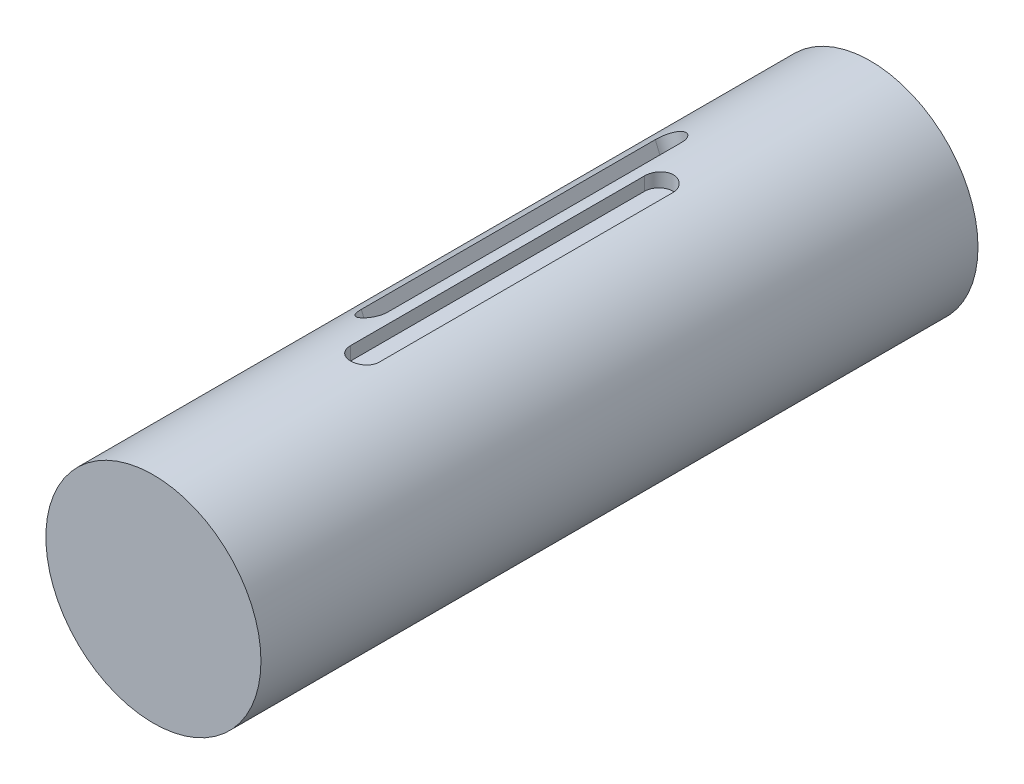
ISO-10303-21;
HEADER;
FILE_DESCRIPTION(('STEP AP214'),'2;1');
FILE_NAME('part.step','',(''),(''),'','','');
FILE_SCHEMA(('AUTOMOTIVE_DESIGN { 1 0 10303 214 1 1 1 1 }'));
ENDSEC;
DATA;
#1=APPLICATION_CONTEXT('core data for automotive mechanical design processes');
#2=APPLICATION_PROTOCOL_DEFINITION('international standard','automotive_design',2000,#1);
#3=PRODUCT_CONTEXT('',#1,'mechanical');
#4=PRODUCT('Part','Part','',(#3));
#5=PRODUCT_RELATED_PRODUCT_CATEGORY('part','',(#4));
#6=PRODUCT_DEFINITION_FORMATION('','',#4);
#7=PRODUCT_DEFINITION_CONTEXT('part definition',#1,'design');
#8=PRODUCT_DEFINITION('design','',#6,#7);
#9=PRODUCT_DEFINITION_SHAPE('','',#8);
#10=(LENGTH_UNIT() NAMED_UNIT(*) SI_UNIT(.MILLI.,.METRE.));
#11=(NAMED_UNIT(*) PLANE_ANGLE_UNIT() SI_UNIT($,.RADIAN.));
#12=(NAMED_UNIT(*) SI_UNIT($,.STERADIAN.) SOLID_ANGLE_UNIT());
#13=UNCERTAINTY_MEASURE_WITH_UNIT(LENGTH_MEASURE(1.E-05),#10,'distance_accuracy_value','');
#14=(GEOMETRIC_REPRESENTATION_CONTEXT(3) GLOBAL_UNCERTAINTY_ASSIGNED_CONTEXT((#13)) GLOBAL_UNIT_ASSIGNED_CONTEXT((#10,
#11,#12)) REPRESENTATION_CONTEXT('',''));
#15=CARTESIAN_POINT('',(0.,0.,0.));
#16=DIRECTION('',(0.,0.,1.));
#17=DIRECTION('',(1.,0.,0.));
#18=AXIS2_PLACEMENT_3D('',#15,#16,#17);
#19=CARTESIAN_POINT('',(0.,0.,-50.));
#20=DIRECTION('',(0.,0.,1.));
#21=DIRECTION('',(1.,0.,0.));
#22=AXIS2_PLACEMENT_3D('',#19,#20,#21);
#23=CYLINDRICAL_SURFACE('',#22,15.);
#24=CARTESIAN_POINT('',(-3.80554326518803,14.5092329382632,-27.5));
#25=CARTESIAN_POINT('',(-3.80554262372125,14.509231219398,-27.5559903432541));
#26=CARTESIAN_POINT('',(-3.80784030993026,14.5086306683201,-27.6119536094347));
#27=CARTESIAN_POINT('',(-3.81700015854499,14.5062242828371,-27.7234746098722));
#28=CARTESIAN_POINT('',(-3.82386194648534,14.5044185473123,-27.7790323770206));
#29=CARTESIAN_POINT('',(-3.85120980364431,14.4971914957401,-27.9443668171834));
#30=CARTESIAN_POINT('',(-3.87845865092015,14.4899603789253,-28.0530279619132));
#31=CARTESIAN_POINT('',(-3.95007976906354,14.4705987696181,-28.2640593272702));
#32=CARTESIAN_POINT('',(-3.99445723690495,14.458466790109,-28.3664276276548));
#33=CARTESIAN_POINT('',(-4.09887286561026,14.4292123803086,-28.5620626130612));
#34=CARTESIAN_POINT('',(-4.15891011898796,14.4120902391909,-28.6553298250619));
#35=CARTESIAN_POINT('',(-4.29312661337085,14.3726813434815,-28.8307008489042));
#36=CARTESIAN_POINT('',(-4.3673853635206,14.3503653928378,-28.9127372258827));
#37=CARTESIAN_POINT('',(-4.52752033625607,14.3006494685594,-29.0627508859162));
#38=CARTESIAN_POINT('',(-4.61339834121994,14.2732487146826,-29.1307260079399));
#39=CARTESIAN_POINT('',(-4.79451924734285,14.2134339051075,-29.2509340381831));
#40=CARTESIAN_POINT('',(-4.88979857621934,14.1810000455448,-29.3031022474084));
#41=CARTESIAN_POINT('',(-5.0865345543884,14.111627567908,-29.3898012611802));
#42=CARTESIAN_POINT('',(-5.18799058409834,14.0746894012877,-29.4243338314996));
#43=CARTESIAN_POINT('',(-5.39343195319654,13.9972449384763,-29.4745861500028));
#44=CARTESIAN_POINT('',(-5.497398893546,13.95676092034,-29.4904154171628));
#45=CARTESIAN_POINT('',(-5.70538260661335,13.8730376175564,-29.5031483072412));
#46=CARTESIAN_POINT('',(-5.80939937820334,13.8297983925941,-29.5000523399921));
#47=CARTESIAN_POINT('',(-6.01382113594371,13.7421340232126,-29.4751098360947));
#48=CARTESIAN_POINT('',(-6.11424539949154,13.6977185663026,-29.4533869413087));
#49=CARTESIAN_POINT('',(-6.30945608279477,13.6089041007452,-29.3919977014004));
#50=CARTESIAN_POINT('',(-6.40424242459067,13.5645050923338,-29.3523311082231));
#51=CARTESIAN_POINT('',(-6.58594887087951,13.4772206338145,-29.2560677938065));
#52=CARTESIAN_POINT('',(-6.67284644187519,13.4343397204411,-29.1994244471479));
#53=CARTESIAN_POINT('',(-6.83629304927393,13.3519095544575,-29.0708514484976));
#54=CARTESIAN_POINT('',(-6.9128419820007,13.3123603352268,-28.9989216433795));
#55=CARTESIAN_POINT('',(-7.05426616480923,13.2379671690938,-28.8411704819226));
#56=CARTESIAN_POINT('',(-7.11904874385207,13.203161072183,-28.7552481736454));
#57=CARTESIAN_POINT('',(-7.23466425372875,13.1401667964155,-28.572262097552));
#58=CARTESIAN_POINT('',(-7.28549306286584,13.1119805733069,-28.4751950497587));
#59=CARTESIAN_POINT('',(-7.37199375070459,13.0635438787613,-28.2725465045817));
#60=CARTESIAN_POINT('',(-7.40764574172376,13.0433038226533,-28.1669540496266));
#61=CARTESIAN_POINT('',(-7.46277304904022,13.0118424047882,-27.9504306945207));
#62=CARTESIAN_POINT('',(-7.48227262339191,13.0006075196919,-27.8395080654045));
#63=CARTESIAN_POINT('',(-7.49726210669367,12.9919617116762,-27.6898156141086));
#64=CARTESIAN_POINT('',(-7.500100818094,12.9903229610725,-27.6518928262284));
#65=CARTESIAN_POINT('',(-7.50388118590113,12.9881397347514,-27.5759854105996));
#66=CARTESIAN_POINT('',(-7.50482602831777,12.9875934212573,-27.5380009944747));
#67=CARTESIAN_POINT('',(-7.50482793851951,12.987592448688,-27.5));
#68=B_SPLINE_CURVE_WITH_KNOTS('',3,(#24,#25,#26,#27,#28,#29,#30,#31,#32,#33,#34,#35,#36,#37,#38,
#39,#40,#41,#42,#43,#44,#45,#46,#47,#48,#49,#50,#51,#52,#53,#54,#55,#56,#57,#58,#59,#60,#61,#62,
#63,#64,#65,#66,#67),.UNSPECIFIED.,.F.,.F.,(4,2,2,2,2,2,2,2,2,2,2,2,2,2,2,2,2,2,2,2,2,4),(0.,
0.167867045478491,0.335720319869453,0.670765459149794,1.00591233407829,1.34103979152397,
1.6780986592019,2.01520929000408,2.35368166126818,2.69212013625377,3.02856687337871,
3.36500632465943,3.69922969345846,4.03345768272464,4.36861215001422,4.70376997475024,
5.04146271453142,5.37925509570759,5.71748876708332,6.0552135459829,6.16935992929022,
6.28331412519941),.UNSPECIFIED.);
#69=CARTESIAN_POINT('',(-3.80554326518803,14.5092329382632,-27.5));
#70=VERTEX_POINT('',#69);
#71=CARTESIAN_POINT('',(-7.50482793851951,12.987592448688,-27.5));
#72=VERTEX_POINT('',#71);
#73=EDGE_CURVE('E11',#70,#72,#68,.T.);
#74=ORIENTED_EDGE('',*,*,#73,.F.);
#75=DIRECTION('',(0.,0.,1.));
#76=VECTOR('',#75,1.);
#77=CARTESIAN_POINT('',(-3.80554326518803,14.5092329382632,-50.));
#78=LINE('',#77,#76);
#79=CARTESIAN_POINT('',(-3.80554326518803,14.5092329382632,13.5));
#80=VERTEX_POINT('',#79);
#81=EDGE_CURVE('E104',#80,#70,#78,.F.);
#82=ORIENTED_EDGE('',*,*,#81,.F.);
#83=CARTESIAN_POINT('',(-7.50482793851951,12.987592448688,13.5));
#84=CARTESIAN_POINT('',(-7.50482715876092,12.9875907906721,13.5560131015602));
#85=CARTESIAN_POINT('',(-7.50277163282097,12.9887809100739,13.6119991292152));
#86=CARTESIAN_POINT('',(-7.49456837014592,12.9935167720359,13.7235657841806));
#87=CARTESIAN_POINT('',(-7.48842096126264,12.9970623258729,13.7791464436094));
#88=CARTESIAN_POINT('',(-7.4638981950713,13.0111722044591,13.9445521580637));
#89=CARTESIAN_POINT('',(-7.43944213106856,13.0252099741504,14.0532616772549));
#90=CARTESIAN_POINT('',(-7.37490663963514,13.0618571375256,14.2643887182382));
#91=CARTESIAN_POINT('',(-7.33482232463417,13.0844692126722,14.3668042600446));
#92=CARTESIAN_POINT('',(-7.24000186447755,13.1371726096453,14.5625256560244));
#93=CARTESIAN_POINT('',(-7.18526668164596,13.1672634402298,14.655832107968));
#94=CARTESIAN_POINT('',(-7.06212158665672,13.2337200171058,14.8312341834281));
#95=CARTESIAN_POINT('',(-6.99363958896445,13.2701186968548,14.9132666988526));
#96=CARTESIAN_POINT('',(-6.84483743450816,13.3474798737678,15.063261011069));
#97=CARTESIAN_POINT('',(-6.76451548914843,13.3884430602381,15.1312206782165));
#98=CARTESIAN_POINT('',(-6.59373460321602,13.4733728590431,15.2513480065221));
#99=CARTESIAN_POINT('',(-6.50324144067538,13.5173494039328,15.3034600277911));
#100=CARTESIAN_POINT('',(-6.31470434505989,13.6064457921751,15.3900512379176));
#101=CARTESIAN_POINT('',(-6.21666117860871,13.6515655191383,15.4245322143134));
#102=CARTESIAN_POINT('',(-6.01628444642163,13.7410437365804,15.4746891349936));
#103=CARTESIAN_POINT('',(-5.91398001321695,13.7854051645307,15.4904761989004));
#104=CARTESIAN_POINT('',(-5.70740378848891,13.8722056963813,15.5031450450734));
#105=CARTESIAN_POINT('',(-5.60313203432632,13.9146448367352,15.5000271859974));
#106=CARTESIAN_POINT('',(-5.39627285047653,13.996161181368,15.4750621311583));
#107=CARTESIAN_POINT('',(-5.29367901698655,14.0352573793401,15.4533297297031));
#108=CARTESIAN_POINT('',(-5.09250651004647,14.1094961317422,15.3919354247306));
#109=CARTESIAN_POINT('',(-4.99392790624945,14.1446386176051,15.3522732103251));
#110=CARTESIAN_POINT('',(-4.80336236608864,14.2104862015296,15.2560056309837));
#111=CARTESIAN_POINT('',(-4.7113986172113,14.241176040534,15.1993439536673));
#112=CARTESIAN_POINT('',(-4.53716925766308,14.2976394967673,15.0707294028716));
#113=CARTESIAN_POINT('',(-4.45490375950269,14.323413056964,14.9987763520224));
#114=CARTESIAN_POINT('',(-4.30196859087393,14.3700912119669,14.8409581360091));
#115=CARTESIAN_POINT('',(-4.23139348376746,14.3909566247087,14.7549897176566));
#116=CARTESIAN_POINT('',(-4.10482638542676,14.4275693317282,14.5718986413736));
#117=CARTESIAN_POINT('',(-4.04883868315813,14.4433151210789,14.4747727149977));
#118=CARTESIAN_POINT('',(-3.95325950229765,14.4697688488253,14.2720362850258));
#119=CARTESIAN_POINT('',(-3.91368284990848,14.4804722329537,14.1664182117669));
#120=CARTESIAN_POINT('',(-3.85238664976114,14.4969010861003,13.949841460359));
#121=CARTESIAN_POINT('',(-3.83064017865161,14.5026340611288,13.8388911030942));
#122=CARTESIAN_POINT('',(-3.81395139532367,14.5070252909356,13.6892787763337));
#123=CARTESIAN_POINT('',(-3.8107970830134,14.5078540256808,13.6514629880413));
#124=CARTESIAN_POINT('',(-3.80659580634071,14.5089570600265,13.5757701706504));
#125=CARTESIAN_POINT('',(-3.80554530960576,14.5092322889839,13.5378933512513));
#126=CARTESIAN_POINT('',(-3.80554326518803,14.5092329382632,13.5));
#127=B_SPLINE_CURVE_WITH_KNOTS('',3,(#83,#84,#85,#86,#87,#88,#89,#90,#91,#92,#93,#94,#95,#96,
#97,#98,#99,#100,#101,#102,#103,#104,#105,#106,#107,#108,#109,#110,#111,#112,#113,#114,#115,
#116,#117,#118,#119,#120,#121,#122,#123,#124,#125,#126),.UNSPECIFIED.,.F.,.F.,(4,2,2,2,2,2,2,2,
2,2,2,2,2,2,2,2,2,2,2,2,2,4),(0.,0.167935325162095,0.335857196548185,0.671047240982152,
1.00634219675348,1.34161513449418,1.67869439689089,2.01582463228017,2.35412519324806,
2.69239144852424,3.02863673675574,3.36487564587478,3.69905580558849,4.0332417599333,
4.36854719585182,4.70385652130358,5.04175810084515,5.37975891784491,5.71806443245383,
6.05585816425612,6.16968090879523,6.28331238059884),.UNSPECIFIED.);
#128=CARTESIAN_POINT('',(-7.50482793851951,12.987592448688,13.5));
#129=VERTEX_POINT('',#128);
#130=EDGE_CURVE('E190',#129,#80,#127,.T.);
#131=ORIENTED_EDGE('',*,*,#130,.F.);
#132=DIRECTION('',(0.,0.,1.));
#133=VECTOR('',#132,1.);
#134=CARTESIAN_POINT('',(-7.50482793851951,12.987592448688,-50.));
#135=LINE('',#134,#133);
#136=EDGE_CURVE('E45',#72,#129,#135,.T.);
#137=ORIENTED_EDGE('',*,*,#136,.F.);
#138=EDGE_LOOP('',(#74,#82,#131,#137));
#139=FACE_BOUND('',#138,.T.);
#140=CARTESIAN_POINT('',(2.,14.8660687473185,-20.5));
#141=CARTESIAN_POINT('',(1.99999992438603,14.8660669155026,-20.5560018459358));
#142=CARTESIAN_POINT('',(1.9976463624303,14.8663855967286,-20.6119766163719));
#143=CARTESIAN_POINT('',(1.98825899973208,14.8676447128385,-20.7235206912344));
#144=CARTESIAN_POINT('',(1.98122557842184,14.8685850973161,-20.7790900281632));
#145=CARTESIAN_POINT('',(1.95318170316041,14.8723051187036,-20.9444604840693));
#146=CARTESIAN_POINT('',(1.92522739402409,14.8759837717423,-21.0531460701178));
#147=CARTESIAN_POINT('',(1.85161406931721,14.8853244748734,-21.2642257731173));
#148=CARTESIAN_POINT('',(1.80594959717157,14.8909871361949,-21.3666179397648));
#149=CARTESIAN_POINT('',(1.69823201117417,14.9036551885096,-21.5622965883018));
#150=CARTESIAN_POINT('',(1.63617991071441,14.9106604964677,-21.6555836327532));
#151=CARTESIAN_POINT('',(1.49703717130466,14.9252733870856,-21.8309704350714));
#152=CARTESIAN_POINT('',(1.41986463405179,14.9328841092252,-21.9130049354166));
#153=CARTESIAN_POINT('',(1.25283835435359,14.9478230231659,-22.0630089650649));
#154=CARTESIAN_POINT('',(1.16298268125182,14.9551511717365,-22.1309763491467));
#155=CARTESIAN_POINT('',(0.972728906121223,14.9687311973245,-22.2511437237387));
#156=CARTESIAN_POINT('',(0.872292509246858,14.974978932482,-22.3032835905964));
#157=CARTESIAN_POINT('',(0.663997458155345,14.9856587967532,-22.3899281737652));
#158=CARTESIAN_POINT('',(0.556139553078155,14.9900911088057,-22.4244346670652));
#159=CARTESIAN_POINT('',(0.336736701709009,14.9966188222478,-22.474638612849));
#160=CARTESIAN_POINT('',(0.225217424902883,14.998727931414,-22.4904464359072));
#161=CARTESIAN_POINT('',(0.0010877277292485,15.000418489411,-22.5031466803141));
#162=CARTESIAN_POINT('',(-0.111522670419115,14.9999999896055,-22.5000394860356));
#163=CARTESIAN_POINT('',(-0.333880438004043,14.9966934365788,-22.4750852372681));
#164=CARTESIAN_POINT('',(-0.443641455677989,14.9938210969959,-22.4533574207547));
#165=CARTESIAN_POINT('',(-0.657944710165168,14.985947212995,-22.3919654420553));
#166=CARTESIAN_POINT('',(-0.762486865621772,14.980945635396,-22.3523010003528));
#167=CARTESIAN_POINT('',(-0.96375389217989,14.9693480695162,-22.2560355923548));
#168=CARTESIAN_POINT('',(-1.06045385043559,14.9627472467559,-22.1993831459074));
#169=CARTESIAN_POINT('',(-1.2430152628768,14.9486891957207,-22.0707896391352));
#170=CARTESIAN_POINT('',(-1.32887659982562,14.9412319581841,-21.9988484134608));
#171=CARTESIAN_POINT('',(-1.48801842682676,14.9262269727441,-21.8410641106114));
#172=CARTESIAN_POINT('',(-1.56119765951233,14.9186789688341,-21.7551189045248));
#173=CARTESIAN_POINT('',(-1.69213014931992,14.904396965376,-21.5720807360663));
#174=CARTESIAN_POINT('',(-1.74987885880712,14.897663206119,-21.4749844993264));
#175=CARTESIAN_POINT('',(-1.84831844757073,14.8857713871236,-21.2722922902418));
#176=CARTESIAN_POINT('',(-1.88899037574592,14.880615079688,-21.1666870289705));
#177=CARTESIAN_POINT('',(-1.9519345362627,14.8724905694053,-20.9501370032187));
#178=CARTESIAN_POINT('',(-1.97423443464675,14.8695190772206,-20.8392005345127));
#179=CARTESIAN_POINT('',(-1.99136249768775,14.8672285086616,-20.6895480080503));
#180=CARTESIAN_POINT('',(-1.99460306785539,14.8667939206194,-20.6516785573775));
#181=CARTESIAN_POINT('',(-1.99891893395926,14.8662143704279,-20.57587811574));
#182=CARTESIAN_POINT('',(-1.99999786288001,14.8660689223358,-20.5379473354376));
#183=CARTESIAN_POINT('',(-2.,14.8660687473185,-20.5));
#184=B_SPLINE_CURVE_WITH_KNOTS('',3,(#140,#141,#142,#143,#144,#145,#146,#147,#148,#149,#150,
#151,#152,#153,#154,#155,#156,#157,#158,#159,#160,#161,#162,#163,#164,#165,#166,#167,#168,#169,
#170,#171,#172,#173,#174,#175,#176,#177,#178,#179,#180,#181,#182,#183),.UNSPECIFIED.,.F.,.F.,(4,
2,2,2,2,2,2,2,2,2,2,2,2,2,2,2,2,2,2,2,2,4),(0.,0.167901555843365,0.335789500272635,
0.670907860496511,1.00612955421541,1.34133052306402,1.67839993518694,2.01552071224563,
2.3539065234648,2.69225822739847,3.02860265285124,3.36494024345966,3.69914003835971,
4.03334504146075,4.36857322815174,4.7038050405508,5.04160111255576,5.37949662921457,
5.71776614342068,6.05552532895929,6.16951038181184,6.28330370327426),.UNSPECIFIED.);
#185=CARTESIAN_POINT('',(2.,14.8660687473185,-20.5));
#186=VERTEX_POINT('',#185);
#187=CARTESIAN_POINT('',(-2.,14.8660687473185,-20.5));
#188=VERTEX_POINT('',#187);
#189=EDGE_CURVE('E184',#186,#188,#184,.T.);
#190=ORIENTED_EDGE('',*,*,#189,.F.);
#191=DIRECTION('',(0.,0.,1.));
#192=VECTOR('',#191,1.);
#193=CARTESIAN_POINT('',(2.,14.8660687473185,-50.));
#194=LINE('',#193,#192);
#195=CARTESIAN_POINT('',(2.,14.8660687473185,20.5));
#196=VERTEX_POINT('',#195);
#197=EDGE_CURVE('E153',#196,#186,#194,.F.);
#198=ORIENTED_EDGE('',*,*,#197,.F.);
#199=CARTESIAN_POINT('',(-2.,14.8660687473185,20.5));
#200=CARTESIAN_POINT('',(-1.99999992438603,14.8660669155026,20.5560018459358));
#201=CARTESIAN_POINT('',(-1.9976463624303,14.8663855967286,20.6119766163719));
#202=CARTESIAN_POINT('',(-1.98825899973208,14.8676447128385,20.7235206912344));
#203=CARTESIAN_POINT('',(-1.98122557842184,14.8685850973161,20.7790900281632));
#204=CARTESIAN_POINT('',(-1.95318170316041,14.8723051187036,20.9444604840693));
#205=CARTESIAN_POINT('',(-1.92522739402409,14.8759837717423,21.0531460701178));
#206=CARTESIAN_POINT('',(-1.85161406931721,14.8853244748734,21.2642257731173));
#207=CARTESIAN_POINT('',(-1.80594959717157,14.8909871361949,21.3666179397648));
#208=CARTESIAN_POINT('',(-1.69823201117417,14.9036551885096,21.5622965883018));
#209=CARTESIAN_POINT('',(-1.63617991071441,14.9106604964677,21.6555836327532));
#210=CARTESIAN_POINT('',(-1.49703717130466,14.9252733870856,21.8309704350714));
#211=CARTESIAN_POINT('',(-1.41986463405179,14.9328841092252,21.9130049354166));
#212=CARTESIAN_POINT('',(-1.25283835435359,14.9478230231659,22.0630089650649));
#213=CARTESIAN_POINT('',(-1.16298268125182,14.9551511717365,22.1309763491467));
#214=CARTESIAN_POINT('',(-0.972728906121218,14.9687311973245,22.2511437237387));
#215=CARTESIAN_POINT('',(-0.872292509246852,14.974978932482,22.3032835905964));
#216=CARTESIAN_POINT('',(-0.663997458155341,14.9856587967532,22.3899281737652));
#217=CARTESIAN_POINT('',(-0.556139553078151,14.9900911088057,22.4244346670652));
#218=CARTESIAN_POINT('',(-0.336736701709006,14.9966188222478,22.474638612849));
#219=CARTESIAN_POINT('',(-0.22521742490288,14.998727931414,22.4904464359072));
#220=CARTESIAN_POINT('',(-0.00108772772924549,15.000418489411,22.5031466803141));
#221=CARTESIAN_POINT('',(0.111522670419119,14.9999999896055,22.5000394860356));
#222=CARTESIAN_POINT('',(0.333880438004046,14.9966934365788,22.4750852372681));
#223=CARTESIAN_POINT('',(0.443641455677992,14.9938210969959,22.4533574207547));
#224=CARTESIAN_POINT('',(0.657944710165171,14.985947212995,22.3919654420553));
#225=CARTESIAN_POINT('',(0.762486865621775,14.980945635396,22.3523010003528));
#226=CARTESIAN_POINT('',(0.963753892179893,14.9693480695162,22.2560355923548));
#227=CARTESIAN_POINT('',(1.06045385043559,14.9627472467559,22.1993831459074));
#228=CARTESIAN_POINT('',(1.2430152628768,14.9486891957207,22.0707896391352));
#229=CARTESIAN_POINT('',(1.32887659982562,14.9412319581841,21.9988484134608));
#230=CARTESIAN_POINT('',(1.48801842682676,14.9262269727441,21.8410641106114));
#231=CARTESIAN_POINT('',(1.56119765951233,14.9186789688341,21.7551189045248));
#232=CARTESIAN_POINT('',(1.69213014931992,14.904396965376,21.5720807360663));
#233=CARTESIAN_POINT('',(1.74987885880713,14.897663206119,21.4749844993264));
#234=CARTESIAN_POINT('',(1.84831844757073,14.8857713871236,21.2722922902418));
#235=CARTESIAN_POINT('',(1.88899037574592,14.880615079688,21.1666870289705));
#236=CARTESIAN_POINT('',(1.9519345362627,14.8724905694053,20.9501370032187));
#237=CARTESIAN_POINT('',(1.97423443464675,14.8695190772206,20.8392005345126));
#238=CARTESIAN_POINT('',(1.99136249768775,14.8672285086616,20.6895480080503));
#239=CARTESIAN_POINT('',(1.99460306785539,14.8667939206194,20.6516785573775));
#240=CARTESIAN_POINT('',(1.99891893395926,14.8662143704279,20.57587811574));
#241=CARTESIAN_POINT('',(1.99999786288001,14.8660689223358,20.5379473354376));
#242=CARTESIAN_POINT('',(2.,14.8660687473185,20.5));
#243=B_SPLINE_CURVE_WITH_KNOTS('',3,(#199,#200,#201,#202,#203,#204,#205,#206,#207,#208,#209,
#210,#211,#212,#213,#214,#215,#216,#217,#218,#219,#220,#221,#222,#223,#224,#225,#226,#227,#228,
#229,#230,#231,#232,#233,#234,#235,#236,#237,#238,#239,#240,#241,#242),.UNSPECIFIED.,.F.,.F.,(4,
2,2,2,2,2,2,2,2,2,2,2,2,2,2,2,2,2,2,2,2,4),(0.,0.167901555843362,0.335789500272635,
0.670907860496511,1.0061295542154,1.34133052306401,1.67839993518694,2.01552071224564,
2.3539065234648,2.69225822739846,3.02860265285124,3.36494024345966,3.69914003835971,
4.03334504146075,4.36857322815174,4.7038050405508,5.04160111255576,5.37949662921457,
5.71776614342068,6.05552532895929,6.16951038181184,6.28330370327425),.UNSPECIFIED.);
#244=CARTESIAN_POINT('',(-2.,14.8660687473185,20.5));
#245=VERTEX_POINT('',#244);
#246=EDGE_CURVE('E157',#245,#196,#243,.T.);
#247=ORIENTED_EDGE('',*,*,#246,.F.);
#248=DIRECTION('',(0.,0.,1.));
#249=VECTOR('',#248,1.);
#250=CARTESIAN_POINT('',(-2.,14.8660687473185,-50.));
#251=LINE('',#250,#249);
#252=EDGE_CURVE('E163',#188,#245,#251,.T.);
#253=ORIENTED_EDGE('',*,*,#252,.F.);
#254=EDGE_LOOP('',(#190,#198,#247,#253));
#255=FACE_BOUND('',#254,.T.);
#256=CARTESIAN_POINT('',(0.,0.,-50.));
#257=DIRECTION('',(0.,0.,1.));
#258=DIRECTION('',(1.,0.,0.));
#259=AXIS2_PLACEMENT_3D('',#256,#257,#258);
#260=CIRCLE('',#259,15.);
#261=CARTESIAN_POINT('',(15.,0.,-50.));
#262=VERTEX_POINT('',#261);
#263=EDGE_CURVE('E150',#262,#262,#260,.T.);
#264=ORIENTED_EDGE('',*,*,#263,.T.);
#265=EDGE_LOOP('',(#264));
#266=FACE_BOUND('',#265,.T.);
#267=CARTESIAN_POINT('',(0.,0.,50.));
#268=DIRECTION('',(0.,0.,1.));
#269=DIRECTION('',(1.,0.,0.));
#270=AXIS2_PLACEMENT_3D('',#267,#268,#269);
#271=CIRCLE('',#270,15.);
#272=CARTESIAN_POINT('',(15.,0.,50.));
#273=VERTEX_POINT('',#272);
#274=EDGE_CURVE('E145',#273,#273,#271,.T.);
#275=ORIENTED_EDGE('',*,*,#274,.F.);
#276=EDGE_LOOP('',(#275));
#277=FACE_BOUND('',#276,.T.);
#278=ADVANCED_FACE('F33',(#139,#255,#266,#277),#23,.T.);
#279=CARTESIAN_POINT('',(0.,0.,-50.));
#280=DIRECTION('',(0.,0.,1.));
#281=DIRECTION('',(1.,0.,0.));
#282=AXIS2_PLACEMENT_3D('',#279,#280,#281);
#283=PLANE('',#282);
#284=ORIENTED_EDGE('',*,*,#263,.F.);
#285=EDGE_LOOP('',(#284));
#286=FACE_BOUND('',#285,.T.);
#287=ADVANCED_FACE('F183',(#286),#283,.F.);
#288=CARTESIAN_POINT('',(0.,0.,50.));
#289=DIRECTION('',(0.,0.,1.));
#290=DIRECTION('',(1.,0.,0.));
#291=AXIS2_PLACEMENT_3D('',#288,#289,#290);
#292=PLANE('',#291);
#293=ORIENTED_EDGE('',*,*,#274,.T.);
#294=EDGE_LOOP('',(#293));
#295=FACE_BOUND('',#294,.T.);
#296=ADVANCED_FACE('F181',(#295),#292,.T.);
#297=CARTESIAN_POINT('',(0.,18.,-20.5));
#298=DIRECTION('',(0.,-1.,0.));
#299=DIRECTION('',(0.,0.,1.));
#300=AXIS2_PLACEMENT_3D('',#297,#298,#299);
#301=CYLINDRICAL_SURFACE('',#300,2.);
#302=ORIENTED_EDGE('',*,*,#189,.T.);
#303=DIRECTION('',(0.,-1.,0.));
#304=VECTOR('',#303,1.);
#305=CARTESIAN_POINT('',(-2.,18.,-20.5));
#306=LINE('',#305,#304);
#307=CARTESIAN_POINT('',(-2.,13.,-20.5));
#308=VERTEX_POINT('',#307);
#309=EDGE_CURVE('E143',#188,#308,#306,.T.);
#310=ORIENTED_EDGE('',*,*,#309,.T.);
#311=CARTESIAN_POINT('',(0.,13.,-20.5));
#312=DIRECTION('',(0.,-1.,0.));
#313=DIRECTION('',(0.,0.,-1.));
#314=AXIS2_PLACEMENT_3D('',#311,#312,#313);
#315=CIRCLE('',#314,2.);
#316=CARTESIAN_POINT('',(2.,13.,-20.5));
#317=VERTEX_POINT('',#316);
#318=EDGE_CURVE('E128',#308,#317,#315,.T.);
#319=ORIENTED_EDGE('',*,*,#318,.T.);
#320=DIRECTION('',(0.,-1.,0.));
#321=VECTOR('',#320,1.);
#322=CARTESIAN_POINT('',(2.,18.,-20.5));
#323=LINE('',#322,#321);
#324=EDGE_CURVE('E142',#186,#317,#323,.T.);
#325=ORIENTED_EDGE('',*,*,#324,.F.);
#326=EDGE_LOOP('',(#302,#310,#319,#325));
#327=FACE_BOUND('',#326,.T.);
#328=ADVANCED_FACE('F177',(#327),#301,.F.);
#329=CARTESIAN_POINT('',(-2.,18.,-20.5));
#330=DIRECTION('',(-1.,0.,0.));
#331=DIRECTION('',(0.,-1.,0.));
#332=AXIS2_PLACEMENT_3D('',#329,#330,#331);
#333=PLANE('',#332);
#334=ORIENTED_EDGE('',*,*,#252,.T.);
#335=DIRECTION('',(0.,-1.,0.));
#336=VECTOR('',#335,1.);
#337=CARTESIAN_POINT('',(-2.,18.,20.5));
#338=LINE('',#337,#336);
#339=CARTESIAN_POINT('',(-2.,13.,20.5));
#340=VERTEX_POINT('',#339);
#341=EDGE_CURVE('E146',#245,#340,#338,.T.);
#342=ORIENTED_EDGE('',*,*,#341,.T.);
#343=DIRECTION('',(0.,0.,-1.));
#344=VECTOR('',#343,1.);
#345=CARTESIAN_POINT('',(-2.,13.,-20.5));
#346=LINE('',#345,#344);
#347=EDGE_CURVE('E139',#340,#308,#346,.T.);
#348=ORIENTED_EDGE('',*,*,#347,.T.);
#349=ORIENTED_EDGE('',*,*,#309,.F.);
#350=EDGE_LOOP('',(#334,#342,#348,#349));
#351=FACE_BOUND('',#350,.T.);
#352=ADVANCED_FACE('F171',(#351),#333,.F.);
#353=CARTESIAN_POINT('',(0.,18.,20.5));
#354=DIRECTION('',(0.,-1.,0.));
#355=DIRECTION('',(0.,0.,1.));
#356=AXIS2_PLACEMENT_3D('',#353,#354,#355);
#357=CYLINDRICAL_SURFACE('',#356,2.);
#358=ORIENTED_EDGE('',*,*,#246,.T.);
#359=DIRECTION('',(0.,-1.,0.));
#360=VECTOR('',#359,1.);
#361=CARTESIAN_POINT('',(2.,18.,20.5));
#362=LINE('',#361,#360);
#363=CARTESIAN_POINT('',(2.,13.,20.5));
#364=VERTEX_POINT('',#363);
#365=EDGE_CURVE('E60',#196,#364,#362,.T.);
#366=ORIENTED_EDGE('',*,*,#365,.T.);
#367=CARTESIAN_POINT('',(0.,13.,20.5));
#368=DIRECTION('',(0.,-1.,0.));
#369=DIRECTION('',(0.,0.,1.));
#370=AXIS2_PLACEMENT_3D('',#367,#368,#369);
#371=CIRCLE('',#370,2.);
#372=EDGE_CURVE('E136',#364,#340,#371,.T.);
#373=ORIENTED_EDGE('',*,*,#372,.T.);
#374=ORIENTED_EDGE('',*,*,#341,.F.);
#375=EDGE_LOOP('',(#358,#366,#373,#374));
#376=FACE_BOUND('',#375,.T.);
#377=ADVANCED_FACE('F165',(#376),#357,.F.);
#378=CARTESIAN_POINT('',(2.,18.,-20.5));
#379=DIRECTION('',(1.,0.,0.));
#380=DIRECTION('',(0.,1.,0.));
#381=AXIS2_PLACEMENT_3D('',#378,#379,#380);
#382=PLANE('',#381);
#383=ORIENTED_EDGE('',*,*,#197,.T.);
#384=ORIENTED_EDGE('',*,*,#324,.T.);
#385=DIRECTION('',(0.,0.,1.));
#386=VECTOR('',#385,1.);
#387=CARTESIAN_POINT('',(2.,13.,-20.5));
#388=LINE('',#387,#386);
#389=EDGE_CURVE('E134',#317,#364,#388,.T.);
#390=ORIENTED_EDGE('',*,*,#389,.T.);
#391=ORIENTED_EDGE('',*,*,#365,.F.);
#392=EDGE_LOOP('',(#383,#384,#390,#391));
#393=FACE_BOUND('',#392,.T.);
#394=ADVANCED_FACE('F170',(#393),#382,.F.);
#395=CARTESIAN_POINT('',(0.,13.,-20.5));
#396=DIRECTION('',(0.,1.,0.));
#397=DIRECTION('',(0.,0.,-1.));
#398=AXIS2_PLACEMENT_3D('',#395,#396,#397);
#399=PLANE('',#398);
#400=ORIENTED_EDGE('',*,*,#318,.F.);
#401=ORIENTED_EDGE('',*,*,#347,.F.);
#402=ORIENTED_EDGE('',*,*,#372,.F.);
#403=ORIENTED_EDGE('',*,*,#389,.F.);
#404=EDGE_LOOP('',(#400,#401,#402,#403));
#405=FACE_BOUND('',#404,.T.);
#406=ADVANCED_FACE('F176',(#405),#399,.T.);
#407=CARTESIAN_POINT('',(-6.85448700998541,16.6437824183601,-27.5));
#408=DIRECTION('',(0.38268343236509,-0.923879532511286,0.));
#409=DIRECTION('',(0.,0.,1.));
#410=AXIS2_PLACEMENT_3D('',#407,#408,#409);
#411=CYLINDRICAL_SURFACE('',#410,2.);
#412=ORIENTED_EDGE('',*,*,#73,.T.);
#413=DIRECTION('',(0.38268343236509,-0.923879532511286,0.));
#414=VECTOR('',#413,1.);
#415=CARTESIAN_POINT('',(-8.70224607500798,15.87841555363,-27.5));
#416=LINE('',#415,#414);
#417=CARTESIAN_POINT('',(-6.78882891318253,11.2590178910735,-27.5));
#418=VERTEX_POINT('',#417);
#419=EDGE_CURVE('E122',#72,#418,#416,.T.);
#420=ORIENTED_EDGE('',*,*,#419,.T.);
#421=CARTESIAN_POINT('',(-4.94106984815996,12.0243847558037,-27.5));
#422=DIRECTION('',(0.38268343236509,-0.923879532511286,0.));
#423=DIRECTION('',(0.,0.,-1.));
#424=AXIS2_PLACEMENT_3D('',#421,#422,#423);
#425=CIRCLE('',#424,2.);
#426=CARTESIAN_POINT('',(-3.09331078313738,12.7897516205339,-27.5));
#427=VERTEX_POINT('',#426);
#428=EDGE_CURVE('E115',#418,#427,#425,.T.);
#429=ORIENTED_EDGE('',*,*,#428,.T.);
#430=DIRECTION('',(0.38268343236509,-0.923879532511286,0.));
#431=VECTOR('',#430,1.);
#432=CARTESIAN_POINT('',(-5.00672794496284,17.4091492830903,-27.5));
#433=LINE('',#432,#431);
#434=EDGE_CURVE('E99',#70,#427,#433,.T.);
#435=ORIENTED_EDGE('',*,*,#434,.F.);
#436=EDGE_LOOP('',(#412,#420,#429,#435));
#437=FACE_BOUND('',#436,.T.);
#438=ADVANCED_FACE('F120',(#437),#411,.F.);
#439=CARTESIAN_POINT('',(-8.70224607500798,15.87841555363,-27.5));
#440=DIRECTION('',(-0.923879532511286,-0.38268343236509,0.));
#441=DIRECTION('',(0.38268343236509,-0.923879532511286,0.));
#442=AXIS2_PLACEMENT_3D('',#439,#440,#441);
#443=PLANE('',#442);
#444=ORIENTED_EDGE('',*,*,#136,.T.);
#445=DIRECTION('',(0.38268343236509,-0.923879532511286,0.));
#446=VECTOR('',#445,1.);
#447=CARTESIAN_POINT('',(-8.70224607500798,15.87841555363,13.5));
#448=LINE('',#447,#446);
#449=CARTESIAN_POINT('',(-6.78882891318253,11.2590178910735,13.5));
#450=VERTEX_POINT('',#449);
#451=EDGE_CURVE('E129',#129,#450,#448,.T.);
#452=ORIENTED_EDGE('',*,*,#451,.T.);
#453=DIRECTION('',(0.,0.,-1.));
#454=VECTOR('',#453,1.);
#455=CARTESIAN_POINT('',(-6.78882891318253,11.2590178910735,-27.5));
#456=LINE('',#455,#454);
#457=EDGE_CURVE('E108',#450,#418,#456,.T.);
#458=ORIENTED_EDGE('',*,*,#457,.T.);
#459=ORIENTED_EDGE('',*,*,#419,.F.);
#460=EDGE_LOOP('',(#444,#452,#458,#459));
#461=FACE_BOUND('',#460,.T.);
#462=ADVANCED_FACE('F200',(#461),#443,.F.);
#463=CARTESIAN_POINT('',(-6.85448700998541,16.6437824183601,13.5));
#464=DIRECTION('',(0.38268343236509,-0.923879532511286,0.));
#465=DIRECTION('',(0.,0.,1.));
#466=AXIS2_PLACEMENT_3D('',#463,#464,#465);
#467=CYLINDRICAL_SURFACE('',#466,2.);
#468=ORIENTED_EDGE('',*,*,#130,.T.);
#469=DIRECTION('',(0.38268343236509,-0.923879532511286,0.));
#470=VECTOR('',#469,1.);
#471=CARTESIAN_POINT('',(-5.00672794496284,17.4091492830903,13.5));
#472=LINE('',#471,#470);
#473=CARTESIAN_POINT('',(-3.09331078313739,12.7897516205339,13.5));
#474=VERTEX_POINT('',#473);
#475=EDGE_CURVE('E52',#80,#474,#472,.T.);
#476=ORIENTED_EDGE('',*,*,#475,.T.);
#477=CARTESIAN_POINT('',(-4.94106984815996,12.0243847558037,13.5));
#478=DIRECTION('',(0.38268343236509,-0.923879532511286,0.));
#479=DIRECTION('',(0.,0.,1.));
#480=AXIS2_PLACEMENT_3D('',#477,#478,#479);
#481=CIRCLE('',#480,2.);
#482=EDGE_CURVE('E118',#474,#450,#481,.T.);
#483=ORIENTED_EDGE('',*,*,#482,.T.);
#484=ORIENTED_EDGE('',*,*,#451,.F.);
#485=EDGE_LOOP('',(#468,#476,#483,#484));
#486=FACE_BOUND('',#485,.T.);
#487=ADVANCED_FACE('F195',(#486),#467,.F.);
#488=CARTESIAN_POINT('',(-5.00672794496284,17.4091492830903,-27.5));
#489=DIRECTION('',(0.923879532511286,0.38268343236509,0.));
#490=DIRECTION('',(-0.38268343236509,0.923879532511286,0.));
#491=AXIS2_PLACEMENT_3D('',#488,#489,#490);
#492=PLANE('',#491);
#493=ORIENTED_EDGE('',*,*,#81,.T.);
#494=ORIENTED_EDGE('',*,*,#434,.T.);
#495=DIRECTION('',(0.,0.,1.));
#496=VECTOR('',#495,1.);
#497=CARTESIAN_POINT('',(-3.09331078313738,12.7897516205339,-27.5));
#498=LINE('',#497,#496);
#499=EDGE_CURVE('E102',#427,#474,#498,.T.);
#500=ORIENTED_EDGE('',*,*,#499,.T.);
#501=ORIENTED_EDGE('',*,*,#475,.F.);
#502=EDGE_LOOP('',(#493,#494,#500,#501));
#503=FACE_BOUND('',#502,.T.);
#504=ADVANCED_FACE('F101',(#503),#492,.F.);
#505=CARTESIAN_POINT('',(-4.94106984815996,12.0243847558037,-27.5));
#506=DIRECTION('',(-0.38268343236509,0.923879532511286,0.));
#507=DIRECTION('',(0.,0.,-1.));
#508=AXIS2_PLACEMENT_3D('',#505,#506,#507);
#509=PLANE('',#508);
#510=ORIENTED_EDGE('',*,*,#428,.F.);
#511=ORIENTED_EDGE('',*,*,#457,.F.);
#512=ORIENTED_EDGE('',*,*,#482,.F.);
#513=ORIENTED_EDGE('',*,*,#499,.F.);
#514=EDGE_LOOP('',(#510,#511,#512,#513));
#515=FACE_BOUND('',#514,.T.);
#516=ADVANCED_FACE('F113',(#515),#509,.T.);
#517=CLOSED_SHELL('',(#278,#287,#296,#328,#352,#377,#394,#406,#438,#462,#487,#504,#516));
#518=MANIFOLD_SOLID_BREP('B2',#517);
#519=ADVANCED_BREP_SHAPE_REPRESENTATION('',(#18,#518),#14);
#520=SHAPE_DEFINITION_REPRESENTATION(#9,#519);
ENDSEC;
END-ISO-10303-21;
